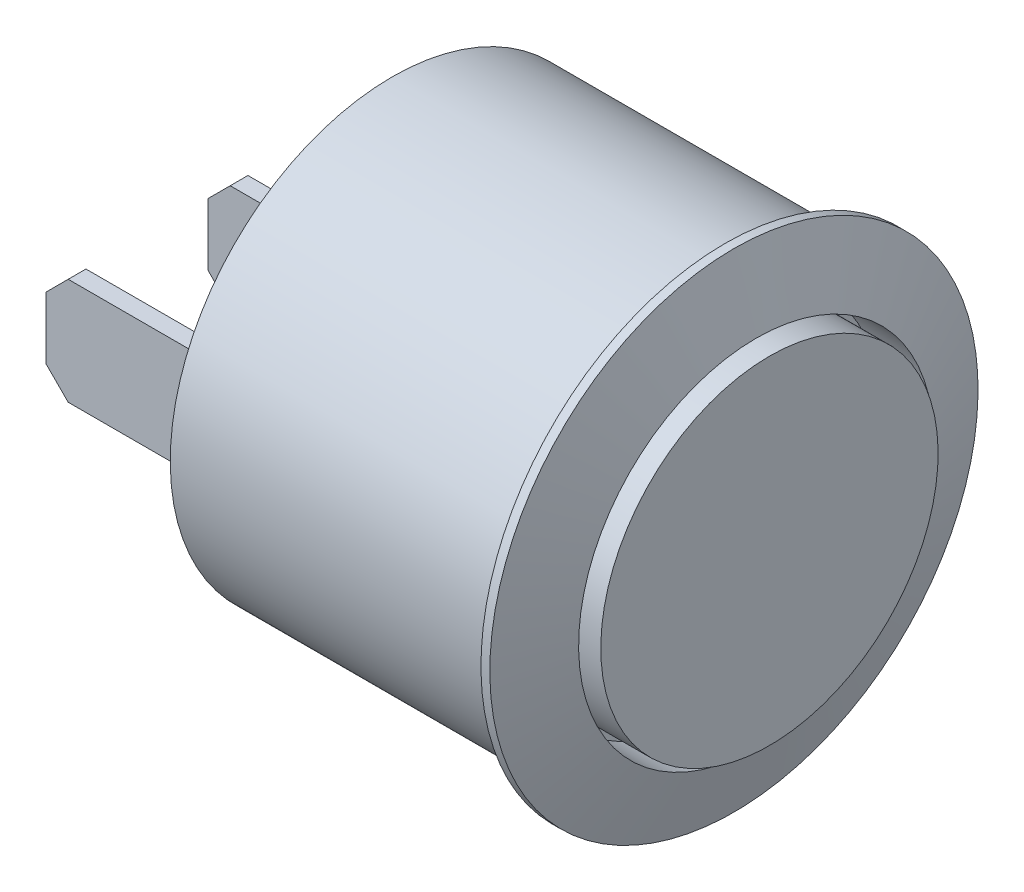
from build123d import *

# Parameters (mm, degrees)
ESQUISSE2_R        = 7.6
BOSS_EXTRU_1_DEPTH = 3
ESQUISSE3_W        = 0.8
ESQUISSE3_H        = 4.8
BOSS_EXTRU_2_DEPTH = 8
CHANFREIN1_SIZE    = 1


with BuildPart() as part:
    # Esquisse1 → R_volution1 (revolve)
    with BuildSketch(Plane.XY):
        Polygon((-33.209806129, 0), (-33.209806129, 10), (-18.209806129, 10), (-18.209806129, 11), (-17.809806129, 11), (-16.809806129, 8), (-19.209806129, 8), (-19.209806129, 0), align=None)
    revolve(axis=Axis((-19.209806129, 0, 0), (-1, 0, 0)))

    # Esquisse2 → Boss.-Extru.1 (add)
    with BuildSketch(Plane(origin=(-19.209806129, 0, 0), x_dir=(0, 0, -1), z_dir=(1, 0, 0))):
        with Locations(Location((0, 0, 0), (0, 0, 90))):
            Circle(ESQUISSE2_R)
    extrude(amount=BOSS_EXTRU_1_DEPTH)

    # Esquisse3 → Boss.-Extru.2 (add)
    with BuildSketch(Plane.ZY.offset(33.209806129)):
        with Locations((-0.1, 0)):
            Rectangle(ESQUISSE3_W, ESQUISSE3_H)
        with Locations((7.2, 0)):
            Rectangle(ESQUISSE3_W, ESQUISSE3_H)
        with Locations((-7.4, 0)):
            Rectangle(ESQUISSE3_W, ESQUISSE3_H)
    extrude(amount=BOSS_EXTRU_2_DEPTH)

    # Chanfrein1
    chanfrein1_edges = [part.edges().sort_by_distance(p)[0] for p in [
        (-41.209806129, -2.4, -0.1),
        (-41.209806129, 2.4, -0.1),
        (-41.209806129, -2.4, 7.2),
        (-41.209806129, 2.4, 7.2),
        (-41.209806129, 2.4, -7.4),
        (-41.209806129, -2.4, -7.4),
    ]]
    chamfer(chanfrein1_edges, length=CHANFREIN1_SIZE)


solid = part.part
